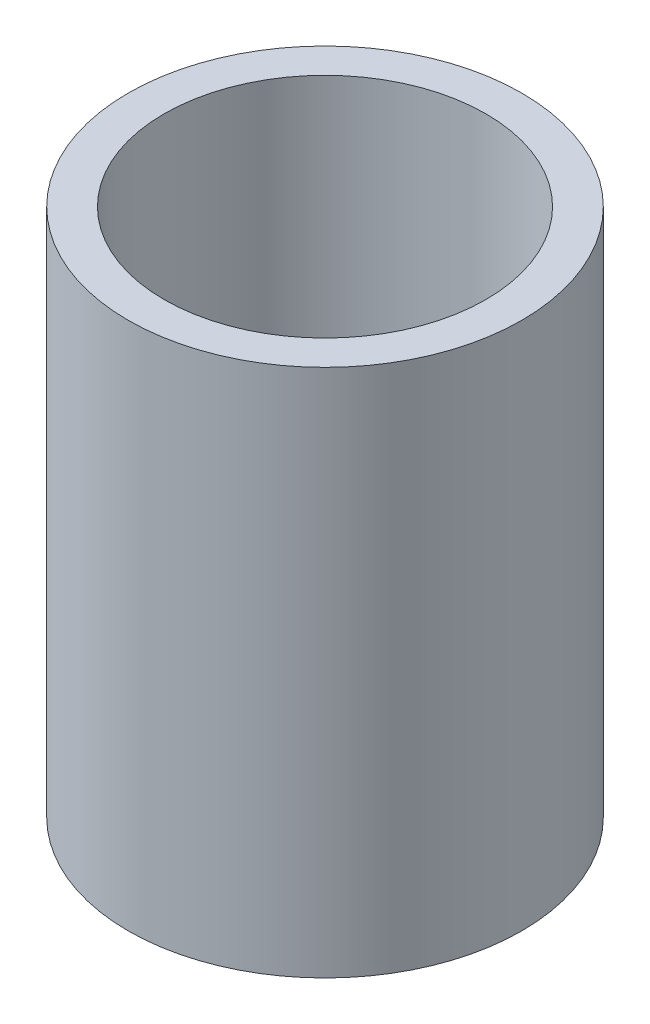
ISO-10303-21;
HEADER;
FILE_DESCRIPTION(('STEP AP214'),'2;1');
FILE_NAME('part.step','',(''),(''),'','','');
FILE_SCHEMA(('AUTOMOTIVE_DESIGN { 1 0 10303 214 1 1 1 1 }'));
ENDSEC;
DATA;
#1=APPLICATION_CONTEXT('core data for automotive mechanical design processes');
#2=APPLICATION_PROTOCOL_DEFINITION('international standard','automotive_design',2000,#1);
#3=PRODUCT_CONTEXT('',#1,'mechanical');
#4=PRODUCT('Part','Part','',(#3));
#5=PRODUCT_RELATED_PRODUCT_CATEGORY('part','',(#4));
#6=PRODUCT_DEFINITION_FORMATION('','',#4);
#7=PRODUCT_DEFINITION_CONTEXT('part definition',#1,'design');
#8=PRODUCT_DEFINITION('design','',#6,#7);
#9=PRODUCT_DEFINITION_SHAPE('','',#8);
#10=(LENGTH_UNIT() NAMED_UNIT(*) SI_UNIT(.MILLI.,.METRE.));
#11=(NAMED_UNIT(*) PLANE_ANGLE_UNIT() SI_UNIT($,.RADIAN.));
#12=(NAMED_UNIT(*) SI_UNIT($,.STERADIAN.) SOLID_ANGLE_UNIT());
#13=UNCERTAINTY_MEASURE_WITH_UNIT(LENGTH_MEASURE(1.E-05),#10,'distance_accuracy_value','');
#14=(GEOMETRIC_REPRESENTATION_CONTEXT(3) GLOBAL_UNCERTAINTY_ASSIGNED_CONTEXT((#13)) GLOBAL_UNIT_ASSIGNED_CONTEXT((#10,
#11,#12)) REPRESENTATION_CONTEXT('',''));
#15=CARTESIAN_POINT('',(0.,0.,0.));
#16=DIRECTION('',(0.,0.,1.));
#17=DIRECTION('',(1.,0.,0.));
#18=AXIS2_PLACEMENT_3D('',#15,#16,#17);
#19=CARTESIAN_POINT('',(10.8204,1.190625,0.));
#20=DIRECTION('',(0.,1.,0.));
#21=DIRECTION('',(0.,0.,1.));
#22=AXIS2_PLACEMENT_3D('',#19,#20,#21);
#23=PLANE('',#22);
#24=CARTESIAN_POINT('',(0.,1.190625,0.));
#25=DIRECTION('',(0.,-1.,0.));
#26=DIRECTION('',(0.,0.,-1.));
#27=AXIS2_PLACEMENT_3D('',#24,#25,#26);
#28=CIRCLE('',#27,8.001);
#29=CARTESIAN_POINT('',(0.,1.190625,-8.001));
#30=VERTEX_POINT('',#29);
#31=EDGE_CURVE('E10',#30,#30,#28,.T.);
#32=ORIENTED_EDGE('',*,*,#31,.T.);
#33=EDGE_LOOP('',(#32));
#34=FACE_BOUND('',#33,.T.);
#35=CARTESIAN_POINT('',(0.,1.190625,0.));
#36=DIRECTION('',(0.,-1.,0.));
#37=DIRECTION('',(0.,0.,-1.));
#38=AXIS2_PLACEMENT_3D('',#35,#36,#37);
#39=CIRCLE('',#38,10.8204);
#40=CARTESIAN_POINT('',(0.,1.190625,-10.8204));
#41=VERTEX_POINT('',#40);
#42=EDGE_CURVE('E58',#41,#41,#39,.T.);
#43=ORIENTED_EDGE('',*,*,#42,.F.);
#44=EDGE_LOOP('',(#43));
#45=FACE_BOUND('',#44,.T.);
#46=ADVANCED_FACE('F30',(#34,#45),#23,.T.);
#47=CARTESIAN_POINT('',(0.,17.78,0.));
#48=DIRECTION('',(0.,-1.,0.));
#49=DIRECTION('',(0.,0.,-1.));
#50=AXIS2_PLACEMENT_3D('',#47,#48,#49);
#51=CYLINDRICAL_SURFACE('',#50,8.001);
#52=CARTESIAN_POINT('',(0.,-1.190625,0.));
#53=DIRECTION('',(0.,-1.,0.));
#54=DIRECTION('',(0.,0.,-1.));
#55=AXIS2_PLACEMENT_3D('',#52,#53,#54);
#56=CIRCLE('',#55,8.001);
#57=CARTESIAN_POINT('',(0.,-1.190625,-8.001));
#58=VERTEX_POINT('',#57);
#59=EDGE_CURVE('E36',#58,#58,#56,.T.);
#60=ORIENTED_EDGE('',*,*,#59,.T.);
#61=EDGE_LOOP('',(#60));
#62=FACE_BOUND('',#61,.T.);
#63=ORIENTED_EDGE('',*,*,#31,.F.);
#64=EDGE_LOOP('',(#63));
#65=FACE_BOUND('',#64,.T.);
#66=ADVANCED_FACE('F66',(#62,#65),#51,.F.);
#67=CARTESIAN_POINT('',(8.001,-1.190625,0.));
#68=DIRECTION('',(0.,-1.,0.));
#69=DIRECTION('',(0.,0.,-1.));
#70=AXIS2_PLACEMENT_3D('',#67,#68,#69);
#71=PLANE('',#70);
#72=CARTESIAN_POINT('',(0.,-1.190625,0.));
#73=DIRECTION('',(0.,-1.,0.));
#74=DIRECTION('',(0.,0.,-1.));
#75=AXIS2_PLACEMENT_3D('',#72,#73,#74);
#76=CIRCLE('',#75,10.8204);
#77=CARTESIAN_POINT('',(0.,-1.190625,-10.8204));
#78=VERTEX_POINT('',#77);
#79=EDGE_CURVE('E40',#78,#78,#76,.T.);
#80=ORIENTED_EDGE('',*,*,#79,.T.);
#81=EDGE_LOOP('',(#80));
#82=FACE_BOUND('',#81,.T.);
#83=ORIENTED_EDGE('',*,*,#59,.F.);
#84=EDGE_LOOP('',(#83));
#85=FACE_BOUND('',#84,.T.);
#86=ADVANCED_FACE('F70',(#82,#85),#71,.T.);
#87=CARTESIAN_POINT('',(0.,17.78,0.));
#88=DIRECTION('',(0.,-1.,0.));
#89=DIRECTION('',(0.,0.,-1.));
#90=AXIS2_PLACEMENT_3D('',#87,#88,#89);
#91=CYLINDRICAL_SURFACE('',#90,10.8204);
#92=CARTESIAN_POINT('',(0.,-17.78,0.));
#93=DIRECTION('',(0.,-1.,0.));
#94=DIRECTION('',(0.,0.,-1.));
#95=AXIS2_PLACEMENT_3D('',#92,#93,#94);
#96=CIRCLE('',#95,10.8204);
#97=CARTESIAN_POINT('',(0.,-17.78,-10.8204));
#98=VERTEX_POINT('',#97);
#99=EDGE_CURVE('E44',#98,#98,#96,.T.);
#100=ORIENTED_EDGE('',*,*,#99,.T.);
#101=EDGE_LOOP('',(#100));
#102=FACE_BOUND('',#101,.T.);
#103=ORIENTED_EDGE('',*,*,#79,.F.);
#104=EDGE_LOOP('',(#103));
#105=FACE_BOUND('',#104,.T.);
#106=ADVANCED_FACE('F74',(#102,#105),#91,.F.);
#107=CARTESIAN_POINT('',(10.8204,-17.78,0.));
#108=DIRECTION('',(0.,-1.,0.));
#109=DIRECTION('',(0.,0.,-1.));
#110=AXIS2_PLACEMENT_3D('',#107,#108,#109);
#111=PLANE('',#110);
#112=CARTESIAN_POINT('',(0.,-17.78,0.));
#113=DIRECTION('',(0.,-1.,0.));
#114=DIRECTION('',(0.,0.,-1.));
#115=AXIS2_PLACEMENT_3D('',#112,#113,#114);
#116=CIRCLE('',#115,13.2334);
#117=CARTESIAN_POINT('',(0.,-17.78,-13.2334));
#118=VERTEX_POINT('',#117);
#119=EDGE_CURVE('E49',#118,#118,#116,.T.);
#120=ORIENTED_EDGE('',*,*,#119,.T.);
#121=EDGE_LOOP('',(#120));
#122=FACE_BOUND('',#121,.T.);
#123=ORIENTED_EDGE('',*,*,#99,.F.);
#124=EDGE_LOOP('',(#123));
#125=FACE_BOUND('',#124,.T.);
#126=ADVANCED_FACE('F81',(#122,#125),#111,.T.);
#127=CARTESIAN_POINT('',(0.,17.78,0.));
#128=DIRECTION('',(0.,-1.,0.));
#129=DIRECTION('',(0.,0.,-1.));
#130=AXIS2_PLACEMENT_3D('',#127,#128,#129);
#131=CYLINDRICAL_SURFACE('',#130,13.2334);
#132=CARTESIAN_POINT('',(0.,17.78,0.));
#133=DIRECTION('',(0.,-1.,0.));
#134=DIRECTION('',(0.,0.,-1.));
#135=AXIS2_PLACEMENT_3D('',#132,#133,#134);
#136=CIRCLE('',#135,13.2334);
#137=CARTESIAN_POINT('',(0.,17.78,-13.2334));
#138=VERTEX_POINT('',#137);
#139=EDGE_CURVE('E52',#138,#138,#136,.T.);
#140=ORIENTED_EDGE('',*,*,#139,.T.);
#141=EDGE_LOOP('',(#140));
#142=FACE_BOUND('',#141,.T.);
#143=ORIENTED_EDGE('',*,*,#119,.F.);
#144=EDGE_LOOP('',(#143));
#145=FACE_BOUND('',#144,.T.);
#146=ADVANCED_FACE('F85',(#142,#145),#131,.T.);
#147=CARTESIAN_POINT('',(13.2334,17.78,0.));
#148=DIRECTION('',(0.,1.,0.));
#149=DIRECTION('',(0.,0.,1.));
#150=AXIS2_PLACEMENT_3D('',#147,#148,#149);
#151=PLANE('',#150);
#152=CARTESIAN_POINT('',(0.,17.78,0.));
#153=DIRECTION('',(0.,-1.,0.));
#154=DIRECTION('',(0.,0.,-1.));
#155=AXIS2_PLACEMENT_3D('',#152,#153,#154);
#156=CIRCLE('',#155,10.8204);
#157=CARTESIAN_POINT('',(0.,17.78,-10.8204));
#158=VERTEX_POINT('',#157);
#159=EDGE_CURVE('E55',#158,#158,#156,.T.);
#160=ORIENTED_EDGE('',*,*,#159,.T.);
#161=EDGE_LOOP('',(#160));
#162=FACE_BOUND('',#161,.T.);
#163=ORIENTED_EDGE('',*,*,#139,.F.);
#164=EDGE_LOOP('',(#163));
#165=FACE_BOUND('',#164,.T.);
#166=ADVANCED_FACE('F89',(#162,#165),#151,.T.);
#167=CARTESIAN_POINT('',(0.,17.78,0.));
#168=DIRECTION('',(0.,-1.,0.));
#169=DIRECTION('',(0.,0.,-1.));
#170=AXIS2_PLACEMENT_3D('',#167,#168,#169);
#171=CYLINDRICAL_SURFACE('',#170,10.8204);
#172=ORIENTED_EDGE('',*,*,#42,.T.);
#173=EDGE_LOOP('',(#172));
#174=FACE_BOUND('',#173,.T.);
#175=ORIENTED_EDGE('',*,*,#159,.F.);
#176=EDGE_LOOP('',(#175));
#177=FACE_BOUND('',#176,.T.);
#178=ADVANCED_FACE('F62',(#174,#177),#171,.F.);
#179=CLOSED_SHELL('',(#46,#66,#86,#106,#126,#146,#166,#178));
#180=MANIFOLD_SOLID_BREP('B2',#179);
#181=ADVANCED_BREP_SHAPE_REPRESENTATION('',(#18,#180),#14);
#182=SHAPE_DEFINITION_REPRESENTATION(#9,#181);
ENDSEC;
END-ISO-10303-21;
